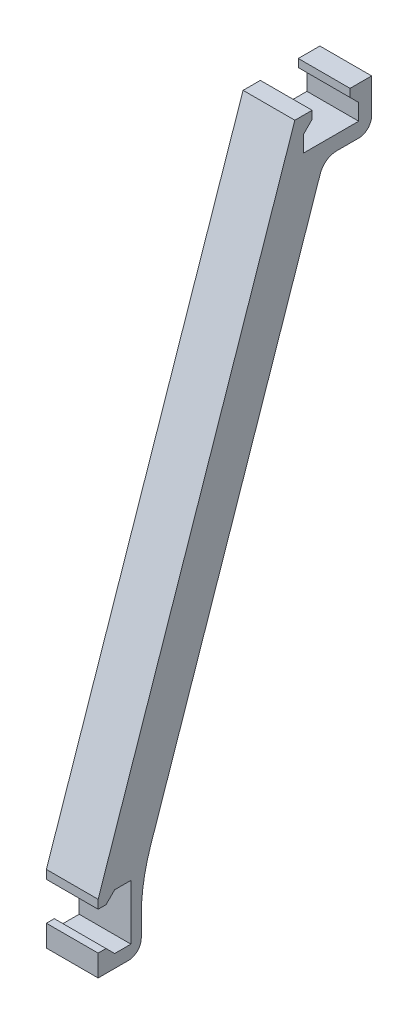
from build123d import *

# Parameters (mm, degrees)
RESSALTO_EXTRUS_O1_DEPTH = 6
FILETE1_R                = 1.5
FILETE3_R                = 20
FILETE4_R                = 2


with BuildPart() as part:
    # Esbo_o1 → Ressalto-extrus_o1 (new body)
    with BuildSketch(Plane.YZ):
        Polygon((-77.8, -10), (-77.8, -10.917157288), (-76.8, -11.917157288), (-76.8, -13.8), (-83.2, -13.8), (-83.2, -11.917157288), (-82.2, -10.917157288), (-82.2, -10), (-84.7, -10), (-84.7, -15), (-77.629791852, -15), (-15.5, -36.20597686), (-15.5, -41.7), (-10, -41.7), (-10, -39.2), (-10.917157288, -39.2), (-11.917157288, -40.2), (-13.8, -40.2), (-13.8, -33.8), (-11.917157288, -33.8), (-10.917157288, -34.8), (-10, -34.8), (-10, -32.8), (-76.8, -10), align=None)
    extrude(amount=RESSALTO_EXTRUS_O1_DEPTH)

    # Filete1
    filete1_edges = [part.edges().sort_by_distance(p)[0] for p in [
        (3, -15.5, -41.7),
        (3, -84.7, -15),
    ]]
    fillet(filete1_edges, radius=FILETE1_R)

    # Filete3
    filete3_edges = [part.edges().sort_by_distance(p)[0] for p in [
        (3, -77.629791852, -15),
    ]]
    fillet(filete3_edges, radius=FILETE3_R)

    # Filete4
    filete4_edges = [part.edges().sort_by_distance(p)[0] for p in [
        (3, -15.5, -36.20597686),
    ]]
    fillet(filete4_edges, radius=FILETE4_R)


solid = part.part
